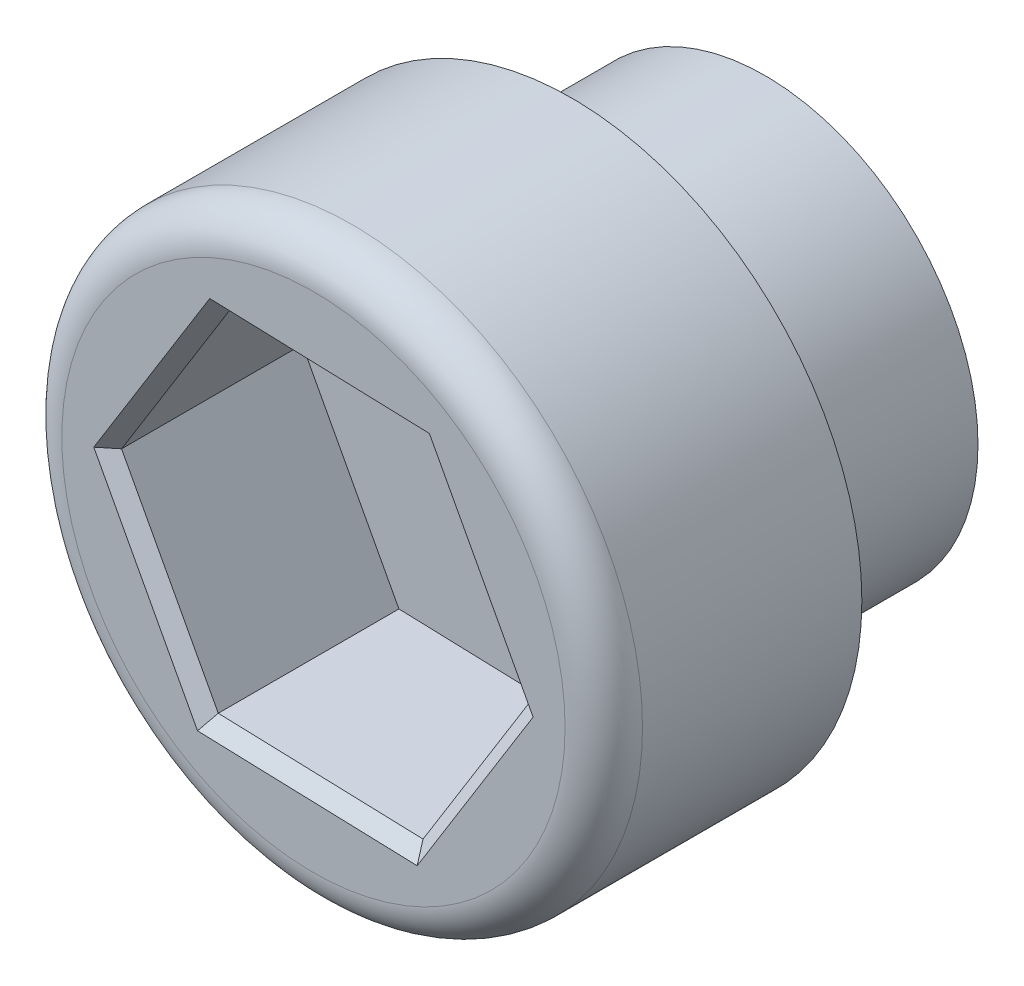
ISO-10303-21;
HEADER;
FILE_DESCRIPTION(('STEP AP214'),'2;1');
FILE_NAME('part.step','',(''),(''),'','','');
FILE_SCHEMA(('AUTOMOTIVE_DESIGN { 1 0 10303 214 1 1 1 1 }'));
ENDSEC;
DATA;
#1=APPLICATION_CONTEXT('core data for automotive mechanical design processes');
#2=APPLICATION_PROTOCOL_DEFINITION('international standard','automotive_design',2000,#1);
#3=PRODUCT_CONTEXT('',#1,'mechanical');
#4=PRODUCT('Part','Part','',(#3));
#5=PRODUCT_RELATED_PRODUCT_CATEGORY('part','',(#4));
#6=PRODUCT_DEFINITION_FORMATION('','',#4);
#7=PRODUCT_DEFINITION_CONTEXT('part definition',#1,'design');
#8=PRODUCT_DEFINITION('design','',#6,#7);
#9=PRODUCT_DEFINITION_SHAPE('','',#8);
#10=(LENGTH_UNIT() NAMED_UNIT(*) SI_UNIT(.MILLI.,.METRE.));
#11=(NAMED_UNIT(*) PLANE_ANGLE_UNIT() SI_UNIT($,.RADIAN.));
#12=(NAMED_UNIT(*) SI_UNIT($,.STERADIAN.) SOLID_ANGLE_UNIT());
#13=UNCERTAINTY_MEASURE_WITH_UNIT(LENGTH_MEASURE(1.E-05),#10,'distance_accuracy_value','');
#14=(GEOMETRIC_REPRESENTATION_CONTEXT(3) GLOBAL_UNCERTAINTY_ASSIGNED_CONTEXT((#13)) GLOBAL_UNIT_ASSIGNED_CONTEXT((#10,
#11,#12)) REPRESENTATION_CONTEXT('',''));
#15=CARTESIAN_POINT('',(0.,0.,0.));
#16=DIRECTION('',(0.,0.,1.));
#17=DIRECTION('',(1.,0.,0.));
#18=AXIS2_PLACEMENT_3D('',#15,#16,#17);
#19=CARTESIAN_POINT('',(0.,0.,3.));
#20=DIRECTION('',(0.,0.,-1.));
#21=DIRECTION('',(-1.,0.,0.));
#22=AXIS2_PLACEMENT_3D('',#19,#20,#21);
#23=CYLINDRICAL_SURFACE('',#22,3.3);
#24=CARTESIAN_POINT('',(0.,0.,3.));
#25=DIRECTION('',(0.,0.,1.));
#26=DIRECTION('',(1.,0.,0.));
#27=AXIS2_PLACEMENT_3D('',#24,#25,#26);
#28=CIRCLE('',#27,3.3);
#29=CARTESIAN_POINT('',(3.3,0.,3.));
#30=VERTEX_POINT('',#29);
#31=EDGE_CURVE('E154',#30,#30,#28,.T.);
#32=ORIENTED_EDGE('',*,*,#31,.F.);
#33=EDGE_LOOP('',(#32));
#34=FACE_BOUND('',#33,.T.);
#35=CARTESIAN_POINT('',(0.,0.,0.));
#36=DIRECTION('',(0.,0.,1.));
#37=DIRECTION('',(1.,0.,0.));
#38=AXIS2_PLACEMENT_3D('',#35,#36,#37);
#39=CIRCLE('',#38,3.3);
#40=CARTESIAN_POINT('',(3.3,0.,0.));
#41=VERTEX_POINT('',#40);
#42=EDGE_CURVE('E153',#41,#41,#39,.T.);
#43=ORIENTED_EDGE('',*,*,#42,.T.);
#44=EDGE_LOOP('',(#43));
#45=FACE_BOUND('',#44,.T.);
#46=ADVANCED_FACE('F33',(#34,#45),#23,.T.);
#47=CARTESIAN_POINT('',(0.,0.,0.));
#48=DIRECTION('',(0.,0.,1.));
#49=DIRECTION('',(1.,0.,0.));
#50=AXIS2_PLACEMENT_3D('',#47,#48,#49);
#51=PLANE('',#50);
#52=ORIENTED_EDGE('',*,*,#42,.F.);
#53=EDGE_LOOP('',(#52));
#54=FACE_BOUND('',#53,.T.);
#55=ADVANCED_FACE('F231',(#54),#51,.F.);
#56=CARTESIAN_POINT('',(0.,0.,7.));
#57=DIRECTION('',(0.,0.,-1.));
#58=DIRECTION('',(-1.,0.,0.));
#59=AXIS2_PLACEMENT_3D('',#56,#57,#58);
#60=CYLINDRICAL_SURFACE('',#59,4.5);
#61=CARTESIAN_POINT('',(0.,0.,6.4));
#62=DIRECTION('',(0.,0.,1.));
#63=DIRECTION('',(1.,0.,0.));
#64=AXIS2_PLACEMENT_3D('',#61,#62,#63);
#65=CIRCLE('',#64,4.5);
#66=CARTESIAN_POINT('',(4.5,0.,6.4));
#67=VERTEX_POINT('',#66);
#68=EDGE_CURVE('E162',#67,#67,#65,.F.);
#69=ORIENTED_EDGE('',*,*,#68,.T.);
#70=EDGE_LOOP('',(#69));
#71=FACE_BOUND('',#70,.T.);
#72=CARTESIAN_POINT('',(0.,0.,3.));
#73=DIRECTION('',(0.,0.,1.));
#74=DIRECTION('',(1.,0.,0.));
#75=AXIS2_PLACEMENT_3D('',#72,#73,#74);
#76=CIRCLE('',#75,4.5);
#77=CARTESIAN_POINT('',(4.5,0.,3.));
#78=VERTEX_POINT('',#77);
#79=EDGE_CURVE('E142',#78,#78,#76,.T.);
#80=ORIENTED_EDGE('',*,*,#79,.T.);
#81=EDGE_LOOP('',(#80));
#82=FACE_BOUND('',#81,.T.);
#83=ADVANCED_FACE('F237',(#71,#82),#60,.T.);
#84=CARTESIAN_POINT('',(0.,0.,7.));
#85=DIRECTION('',(0.,0.,1.));
#86=DIRECTION('',(1.,0.,0.));
#87=AXIS2_PLACEMENT_3D('',#84,#85,#86);
#88=PLANE('',#87);
#89=DIRECTION('',(-0.527537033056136,-0.849532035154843,0.));
#90=VECTOR('',#89,1.);
#91=CARTESIAN_POINT('',(1.66854197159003,-2.90504750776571,7.));
#92=LINE('',#91,#90);
#93=CARTESIAN_POINT('',(3.40461176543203,-0.109325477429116,7.));
#94=VERTEX_POINT('',#93);
#95=CARTESIAN_POINT('',(1.60762724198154,-3.00314301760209,7.));
#96=VERTEX_POINT('',#95);
#97=EDGE_CURVE('E168',#94,#96,#92,.T.);
#98=ORIENTED_EDGE('',*,*,#97,.T.);
#99=DIRECTION('',(-0.999484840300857,0.0320944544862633,0.));
#100=VECTOR('',#99,1.);
#101=CARTESIAN_POINT('',(-1.68157395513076,-2.8975234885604,7.));
#102=LINE('',#101,#100);
#103=CARTESIAN_POINT('',(-1.79698452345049,-2.89381754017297,7.));
#104=VERTEX_POINT('',#103);
#105=EDGE_CURVE('E178',#96,#104,#102,.T.);
#106=ORIENTED_EDGE('',*,*,#105,.T.);
#107=DIRECTION('',(-0.471947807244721,0.881626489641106,0.));
#108=VECTOR('',#107,1.);
#109=CARTESIAN_POINT('',(-3.35011592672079,0.0075240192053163,7.));
#110=LINE('',#109,#108);
#111=CARTESIAN_POINT('',(-3.40461176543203,0.109325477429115,7.));
#112=VERTEX_POINT('',#111);
#113=EDGE_CURVE('E176',#104,#112,#110,.T.);
#114=ORIENTED_EDGE('',*,*,#113,.T.);
#115=DIRECTION('',(0.527537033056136,0.849532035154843,0.));
#116=VECTOR('',#115,1.);
#117=CARTESIAN_POINT('',(-1.66854197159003,2.90504750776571,7.));
#118=LINE('',#117,#116);
#119=CARTESIAN_POINT('',(-1.60762724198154,3.00314301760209,7.));
#120=VERTEX_POINT('',#119);
#121=EDGE_CURVE('E174',#112,#120,#118,.T.);
#122=ORIENTED_EDGE('',*,*,#121,.T.);
#123=DIRECTION('',(0.999484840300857,-0.0320944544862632,0.));
#124=VECTOR('',#123,1.);
#125=CARTESIAN_POINT('',(1.68157395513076,2.8975234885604,7.));
#126=LINE('',#125,#124);
#127=CARTESIAN_POINT('',(1.79698452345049,2.89381754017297,7.));
#128=VERTEX_POINT('',#127);
#129=EDGE_CURVE('E172',#120,#128,#126,.T.);
#130=ORIENTED_EDGE('',*,*,#129,.T.);
#131=DIRECTION('',(0.471947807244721,-0.881626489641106,0.));
#132=VECTOR('',#131,1.);
#133=CARTESIAN_POINT('',(3.35011592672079,-0.00752401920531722,7.));
#134=LINE('',#133,#132);
#135=EDGE_CURVE('E170',#128,#94,#134,.T.);
#136=ORIENTED_EDGE('',*,*,#135,.T.);
#137=EDGE_LOOP('',(#98,#106,#114,#122,#130,#136));
#138=FACE_BOUND('',#137,.T.);
#139=CARTESIAN_POINT('',(0.,0.,7.));
#140=DIRECTION('',(0.,0.,1.));
#141=DIRECTION('',(1.,0.,0.));
#142=AXIS2_PLACEMENT_3D('',#139,#140,#141);
#143=CIRCLE('',#142,3.9);
#144=CARTESIAN_POINT('',(3.9,0.,7.));
#145=VERTEX_POINT('',#144);
#146=EDGE_CURVE('E157',#145,#145,#143,.T.);
#147=ORIENTED_EDGE('',*,*,#146,.T.);
#148=EDGE_LOOP('',(#147));
#149=FACE_BOUND('',#148,.T.);
#150=ADVANCED_FACE('F317',(#138,#149),#88,.T.);
#151=CARTESIAN_POINT('',(0.,0.,3.));
#152=DIRECTION('',(0.,0.,1.));
#153=DIRECTION('',(1.,0.,0.));
#154=AXIS2_PLACEMENT_3D('',#151,#152,#153);
#155=PLANE('',#154);
#156=ORIENTED_EDGE('',*,*,#31,.T.);
#157=EDGE_LOOP('',(#156));
#158=FACE_BOUND('',#157,.T.);
#159=ORIENTED_EDGE('',*,*,#79,.F.);
#160=EDGE_LOOP('',(#159));
#161=FACE_BOUND('',#160,.T.);
#162=ADVANCED_FACE('F227',(#158,#161),#155,.F.);
#163=CARTESIAN_POINT('',(1.67515506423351,2.69762652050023,4.));
#164=DIRECTION('',(0.0320944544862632,0.999484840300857,0.));
#165=DIRECTION('',(-0.999484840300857,0.0320944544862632,0.));
#166=AXIS2_PLACEMENT_3D('',#163,#164,#165);
#167=PLANE('',#166);
#168=DIRECTION('',(0.,0.,1.));
#169=VECTOR('',#168,1.);
#170=CARTESIAN_POINT('',(1.67515506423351,2.69762652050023,4.));
#171=LINE('',#170,#169);
#172=CARTESIAN_POINT('',(1.67515506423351,2.69762652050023,4.));
#173=VERTEX_POINT('',#172);
#174=CARTESIAN_POINT('',(1.67515506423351,2.69762652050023,6.8));
#175=VERTEX_POINT('',#174);
#176=EDGE_CURVE('E140',#173,#175,#171,.T.);
#177=ORIENTED_EDGE('',*,*,#176,.T.);
#178=DIRECTION('',(-0.999484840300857,0.0320944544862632,0.));
#179=VECTOR('',#178,1.);
#180=CARTESIAN_POINT('',(-1.49863556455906,2.79954010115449,6.8));
#181=LINE('',#180,#179);
#182=CARTESIAN_POINT('',(-1.49863556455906,2.79954010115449,6.8));
#183=VERTEX_POINT('',#182);
#184=EDGE_CURVE('E111',#175,#183,#181,.T.);
#185=ORIENTED_EDGE('',*,*,#184,.T.);
#186=DIRECTION('',(0.,0.,1.));
#187=VECTOR('',#186,1.);
#188=CARTESIAN_POINT('',(-1.49863556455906,2.79954010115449,4.));
#189=LINE('',#188,#187);
#190=CARTESIAN_POINT('',(-1.49863556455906,2.79954010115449,4.));
#191=VERTEX_POINT('',#190);
#192=EDGE_CURVE('E104',#191,#183,#189,.T.);
#193=ORIENTED_EDGE('',*,*,#192,.F.);
#194=DIRECTION('',(-0.999484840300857,0.0320944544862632,0.));
#195=VECTOR('',#194,1.);
#196=CARTESIAN_POINT('',(1.67515506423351,2.69762652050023,4.));
#197=LINE('',#196,#195);
#198=EDGE_CURVE('E108',#173,#191,#197,.T.);
#199=ORIENTED_EDGE('',*,*,#198,.F.);
#200=EDGE_LOOP('',(#177,#185,#193,#199));
#201=FACE_BOUND('',#200,.T.);
#202=ADVANCED_FACE('F106',(#201),#167,.F.);
#203=CARTESIAN_POINT('',(3.17379062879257,-0.101913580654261,4.));
#204=DIRECTION('',(0.881626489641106,0.471947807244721,0.));
#205=DIRECTION('',(-0.471947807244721,0.881626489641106,0.));
#206=AXIS2_PLACEMENT_3D('',#203,#204,#205);
#207=PLANE('',#206);
#208=DIRECTION('',(0.,0.,1.));
#209=VECTOR('',#208,1.);
#210=CARTESIAN_POINT('',(3.17379062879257,-0.101913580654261,4.));
#211=LINE('',#210,#209);
#212=CARTESIAN_POINT('',(3.17379062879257,-0.101913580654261,4.));
#213=VERTEX_POINT('',#212);
#214=CARTESIAN_POINT('',(3.17379062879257,-0.101913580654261,6.8));
#215=VERTEX_POINT('',#214);
#216=EDGE_CURVE('E143',#213,#215,#211,.T.);
#217=ORIENTED_EDGE('',*,*,#216,.T.);
#218=DIRECTION('',(-0.471947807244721,0.881626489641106,0.));
#219=VECTOR('',#218,1.);
#220=CARTESIAN_POINT('',(1.67515506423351,2.69762652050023,6.8));
#221=LINE('',#220,#219);
#222=EDGE_CURVE('E42',#215,#175,#221,.T.);
#223=ORIENTED_EDGE('',*,*,#222,.T.);
#224=ORIENTED_EDGE('',*,*,#176,.F.);
#225=DIRECTION('',(-0.471947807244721,0.881626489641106,0.));
#226=VECTOR('',#225,1.);
#227=CARTESIAN_POINT('',(3.17379062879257,-0.101913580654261,4.));
#228=LINE('',#227,#226);
#229=EDGE_CURVE('E115',#213,#173,#228,.T.);
#230=ORIENTED_EDGE('',*,*,#229,.F.);
#231=EDGE_LOOP('',(#217,#223,#224,#230));
#232=FACE_BOUND('',#231,.T.);
#233=ADVANCED_FACE('F219',(#232),#207,.F.);
#234=CARTESIAN_POINT('',(1.49863556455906,-2.79954010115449,4.));
#235=DIRECTION('',(0.849532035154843,-0.527537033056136,0.));
#236=DIRECTION('',(0.527537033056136,0.849532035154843,0.));
#237=AXIS2_PLACEMENT_3D('',#234,#235,#236);
#238=PLANE('',#237);
#239=DIRECTION('',(0.,0.,1.));
#240=VECTOR('',#239,1.);
#241=CARTESIAN_POINT('',(1.49863556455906,-2.79954010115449,4.));
#242=LINE('',#241,#240);
#243=CARTESIAN_POINT('',(1.49863556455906,-2.79954010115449,4.));
#244=VERTEX_POINT('',#243);
#245=CARTESIAN_POINT('',(1.49863556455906,-2.79954010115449,6.8));
#246=VERTEX_POINT('',#245);
#247=EDGE_CURVE('E145',#244,#246,#242,.T.);
#248=ORIENTED_EDGE('',*,*,#247,.T.);
#249=DIRECTION('',(0.527537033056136,0.849532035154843,0.));
#250=VECTOR('',#249,1.);
#251=CARTESIAN_POINT('',(3.17379062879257,-0.101913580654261,6.8));
#252=LINE('',#251,#250);
#253=EDGE_CURVE('E11',#246,#215,#252,.T.);
#254=ORIENTED_EDGE('',*,*,#253,.T.);
#255=ORIENTED_EDGE('',*,*,#216,.F.);
#256=DIRECTION('',(0.527537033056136,0.849532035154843,0.));
#257=VECTOR('',#256,1.);
#258=CARTESIAN_POINT('',(1.49863556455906,-2.79954010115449,4.));
#259=LINE('',#258,#257);
#260=EDGE_CURVE('E137',#244,#213,#259,.T.);
#261=ORIENTED_EDGE('',*,*,#260,.F.);
#262=EDGE_LOOP('',(#248,#254,#255,#261));
#263=FACE_BOUND('',#262,.T.);
#264=ADVANCED_FACE('F218',(#263),#238,.F.);
#265=CARTESIAN_POINT('',(-1.67515506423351,-2.69762652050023,4.));
#266=DIRECTION('',(-0.0320944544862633,-0.999484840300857,0.));
#267=DIRECTION('',(0.999484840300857,-0.0320944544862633,0.));
#268=AXIS2_PLACEMENT_3D('',#265,#266,#267);
#269=PLANE('',#268);
#270=DIRECTION('',(0.,0.,1.));
#271=VECTOR('',#270,1.);
#272=CARTESIAN_POINT('',(-1.67515506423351,-2.69762652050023,4.));
#273=LINE('',#272,#271);
#274=CARTESIAN_POINT('',(-1.67515506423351,-2.69762652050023,4.));
#275=VERTEX_POINT('',#274);
#276=CARTESIAN_POINT('',(-1.67515506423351,-2.69762652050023,6.8));
#277=VERTEX_POINT('',#276);
#278=EDGE_CURVE('E147',#275,#277,#273,.T.);
#279=ORIENTED_EDGE('',*,*,#278,.T.);
#280=DIRECTION('',(0.999484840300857,-0.0320944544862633,0.));
#281=VECTOR('',#280,1.);
#282=CARTESIAN_POINT('',(1.49863556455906,-2.79954010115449,6.8));
#283=LINE('',#282,#281);
#284=EDGE_CURVE('E165',#277,#246,#283,.T.);
#285=ORIENTED_EDGE('',*,*,#284,.T.);
#286=ORIENTED_EDGE('',*,*,#247,.F.);
#287=DIRECTION('',(0.999484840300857,-0.0320944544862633,0.));
#288=VECTOR('',#287,1.);
#289=CARTESIAN_POINT('',(-1.67515506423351,-2.69762652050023,4.));
#290=LINE('',#289,#288);
#291=EDGE_CURVE('E134',#275,#244,#290,.T.);
#292=ORIENTED_EDGE('',*,*,#291,.F.);
#293=EDGE_LOOP('',(#279,#285,#286,#292));
#294=FACE_BOUND('',#293,.T.);
#295=ADVANCED_FACE('F215',(#294),#269,.F.);
#296=CARTESIAN_POINT('',(-3.17379062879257,0.10191358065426,4.));
#297=DIRECTION('',(-0.881626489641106,-0.471947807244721,0.));
#298=DIRECTION('',(0.471947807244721,-0.881626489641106,0.));
#299=AXIS2_PLACEMENT_3D('',#296,#297,#298);
#300=PLANE('',#299);
#301=DIRECTION('',(0.,0.,1.));
#302=VECTOR('',#301,1.);
#303=CARTESIAN_POINT('',(-3.17379062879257,0.10191358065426,4.));
#304=LINE('',#303,#302);
#305=CARTESIAN_POINT('',(-3.17379062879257,0.10191358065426,4.));
#306=VERTEX_POINT('',#305);
#307=CARTESIAN_POINT('',(-3.17379062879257,0.10191358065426,6.8));
#308=VERTEX_POINT('',#307);
#309=EDGE_CURVE('E114',#306,#308,#304,.T.);
#310=ORIENTED_EDGE('',*,*,#309,.T.);
#311=DIRECTION('',(0.471947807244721,-0.881626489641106,0.));
#312=VECTOR('',#311,1.);
#313=CARTESIAN_POINT('',(-1.67515506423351,-2.69762652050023,6.8));
#314=LINE('',#313,#312);
#315=EDGE_CURVE('E181',#308,#277,#314,.T.);
#316=ORIENTED_EDGE('',*,*,#315,.T.);
#317=ORIENTED_EDGE('',*,*,#278,.F.);
#318=DIRECTION('',(0.471947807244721,-0.881626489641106,0.));
#319=VECTOR('',#318,1.);
#320=CARTESIAN_POINT('',(-3.17379062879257,0.10191358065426,4.));
#321=LINE('',#320,#319);
#322=EDGE_CURVE('E124',#306,#275,#321,.T.);
#323=ORIENTED_EDGE('',*,*,#322,.F.);
#324=EDGE_LOOP('',(#310,#316,#317,#323));
#325=FACE_BOUND('',#324,.T.);
#326=ADVANCED_FACE('F211',(#325),#300,.F.);
#327=CARTESIAN_POINT('',(-1.49863556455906,2.79954010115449,4.));
#328=DIRECTION('',(-0.849532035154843,0.527537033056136,0.));
#329=DIRECTION('',(-0.527537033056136,-0.849532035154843,0.));
#330=AXIS2_PLACEMENT_3D('',#327,#328,#329);
#331=PLANE('',#330);
#332=ORIENTED_EDGE('',*,*,#192,.T.);
#333=DIRECTION('',(-0.527537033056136,-0.849532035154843,0.));
#334=VECTOR('',#333,1.);
#335=CARTESIAN_POINT('',(-3.17379062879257,0.10191358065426,6.8));
#336=LINE('',#335,#334);
#337=EDGE_CURVE('E183',#183,#308,#336,.T.);
#338=ORIENTED_EDGE('',*,*,#337,.T.);
#339=ORIENTED_EDGE('',*,*,#309,.F.);
#340=DIRECTION('',(-0.527537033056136,-0.849532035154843,0.));
#341=VECTOR('',#340,1.);
#342=CARTESIAN_POINT('',(-1.49863556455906,2.79954010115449,4.));
#343=LINE('',#342,#341);
#344=EDGE_CURVE('E118',#191,#306,#343,.T.);
#345=ORIENTED_EDGE('',*,*,#344,.F.);
#346=EDGE_LOOP('',(#332,#338,#339,#345));
#347=FACE_BOUND('',#346,.T.);
#348=ADVANCED_FACE('F119',(#347),#331,.F.);
#349=CARTESIAN_POINT('',(0.,0.,4.));
#350=DIRECTION('',(0.,0.,1.));
#351=DIRECTION('',(1.,0.,0.));
#352=AXIS2_PLACEMENT_3D('',#349,#350,#351);
#353=PLANE('',#352);
#354=ORIENTED_EDGE('',*,*,#198,.T.);
#355=ORIENTED_EDGE('',*,*,#344,.T.);
#356=ORIENTED_EDGE('',*,*,#322,.T.);
#357=ORIENTED_EDGE('',*,*,#291,.T.);
#358=ORIENTED_EDGE('',*,*,#260,.T.);
#359=ORIENTED_EDGE('',*,*,#229,.T.);
#360=EDGE_LOOP('',(#354,#355,#356,#357,#358,#359));
#361=FACE_BOUND('',#360,.T.);
#362=ADVANCED_FACE('F126',(#361),#353,.T.);
#363=CARTESIAN_POINT('',(0.,0.,6.4));
#364=DIRECTION('',(0.,0.,1.));
#365=DIRECTION('',(1.,0.,0.));
#366=AXIS2_PLACEMENT_3D('',#363,#364,#365);
#367=TOROIDAL_SURFACE('',#366,3.9,0.6);
#368=ORIENTED_EDGE('',*,*,#68,.F.);
#369=EDGE_LOOP('',(#368));
#370=FACE_BOUND('',#369,.T.);
#371=ORIENTED_EDGE('',*,*,#146,.F.);
#372=EDGE_LOOP('',(#371));
#373=FACE_BOUND('',#372,.T.);
#374=ADVANCED_FACE('F244',(#370,#373),#367,.T.);
#375=CARTESIAN_POINT('',(1.67515506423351,2.69762652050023,6.8));
#376=DIRECTION('',(-0.0226942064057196,-0.706742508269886,0.70710678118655));
#377=DIRECTION('',(0.999484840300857,-0.0320944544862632,0.));
#378=AXIS2_PLACEMENT_3D('',#375,#376,#377);
#379=PLANE('',#378);
#380=DIRECTION('',(-0.398780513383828,-0.642185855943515,-0.654653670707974));
#381=VECTOR('',#380,1.);
#382=CARTESIAN_POINT('',(1.67515506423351,2.69762652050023,6.8));
#383=LINE('',#382,#381);
#384=EDGE_CURVE('E131',#128,#175,#383,.T.);
#385=ORIENTED_EDGE('',*,*,#384,.F.);
#386=ORIENTED_EDGE('',*,*,#129,.F.);
#387=DIRECTION('',(0.356759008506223,-0.666446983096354,-0.654653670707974));
#388=VECTOR('',#387,1.);
#389=CARTESIAN_POINT('',(-1.49863556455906,2.79954010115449,6.8));
#390=LINE('',#389,#388);
#391=EDGE_CURVE('E37',#183,#120,#390,.F.);
#392=ORIENTED_EDGE('',*,*,#391,.F.);
#393=ORIENTED_EDGE('',*,*,#184,.F.);
#394=EDGE_LOOP('',(#385,#386,#392,#393));
#395=FACE_BOUND('',#394,.T.);
#396=ADVANCED_FACE('F35',(#395),#379,.T.);
#397=CARTESIAN_POINT('',(-1.49863556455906,2.79954010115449,6.8));
#398=DIRECTION('',(0.600709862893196,-0.373025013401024,0.70710678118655));
#399=DIRECTION('',(0.527537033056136,0.849532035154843,0.));
#400=AXIS2_PLACEMENT_3D('',#397,#398,#399);
#401=PLANE('',#400);
#402=ORIENTED_EDGE('',*,*,#391,.T.);
#403=ORIENTED_EDGE('',*,*,#121,.F.);
#404=DIRECTION('',(0.755539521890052,-0.024261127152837,-0.654653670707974));
#405=VECTOR('',#404,1.);
#406=CARTESIAN_POINT('',(-3.17379062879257,0.10191358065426,6.8));
#407=LINE('',#406,#405);
#408=EDGE_CURVE('E194',#308,#112,#407,.F.);
#409=ORIENTED_EDGE('',*,*,#408,.F.);
#410=ORIENTED_EDGE('',*,*,#337,.F.);
#411=EDGE_LOOP('',(#402,#403,#409,#410));
#412=FACE_BOUND('',#411,.T.);
#413=ADVANCED_FACE('F208',(#412),#401,.T.);
#414=CARTESIAN_POINT('',(3.17379062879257,-0.101913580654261,6.8));
#415=DIRECTION('',(-0.623404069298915,-0.333717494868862,0.70710678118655));
#416=DIRECTION('',(0.471947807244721,-0.881626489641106,0.));
#417=AXIS2_PLACEMENT_3D('',#414,#415,#416);
#418=PLANE('',#417);
#419=ORIENTED_EDGE('',*,*,#384,.T.);
#420=ORIENTED_EDGE('',*,*,#222,.F.);
#421=DIRECTION('',(-0.755539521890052,0.0242611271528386,-0.654653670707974));
#422=VECTOR('',#421,1.);
#423=CARTESIAN_POINT('',(3.17379062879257,-0.101913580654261,6.8));
#424=LINE('',#423,#422);
#425=EDGE_CURVE('E191',#94,#215,#424,.T.);
#426=ORIENTED_EDGE('',*,*,#425,.F.);
#427=ORIENTED_EDGE('',*,*,#135,.F.);
#428=EDGE_LOOP('',(#419,#420,#426,#427));
#429=FACE_BOUND('',#428,.T.);
#430=ADVANCED_FACE('F200',(#429),#418,.T.);
#431=CARTESIAN_POINT('',(-3.17379062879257,0.10191358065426,6.8));
#432=DIRECTION('',(0.623404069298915,0.333717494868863,0.70710678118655));
#433=DIRECTION('',(-0.471947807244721,0.881626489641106,0.));
#434=AXIS2_PLACEMENT_3D('',#431,#432,#433);
#435=PLANE('',#434);
#436=ORIENTED_EDGE('',*,*,#408,.T.);
#437=ORIENTED_EDGE('',*,*,#113,.F.);
#438=DIRECTION('',(0.398780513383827,0.642185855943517,-0.654653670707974));
#439=VECTOR('',#438,1.);
#440=CARTESIAN_POINT('',(-1.67515506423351,-2.69762652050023,6.8));
#441=LINE('',#440,#439);
#442=EDGE_CURVE('E189',#277,#104,#441,.F.);
#443=ORIENTED_EDGE('',*,*,#442,.F.);
#444=ORIENTED_EDGE('',*,*,#315,.F.);
#445=EDGE_LOOP('',(#436,#437,#443,#444));
#446=FACE_BOUND('',#445,.T.);
#447=ADVANCED_FACE('F255',(#446),#435,.T.);
#448=CARTESIAN_POINT('',(1.49863556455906,-2.79954010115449,6.8));
#449=DIRECTION('',(-0.600709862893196,0.373025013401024,0.70710678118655));
#450=DIRECTION('',(-0.527537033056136,-0.849532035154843,0.));
#451=AXIS2_PLACEMENT_3D('',#448,#449,#450);
#452=PLANE('',#451);
#453=ORIENTED_EDGE('',*,*,#425,.T.);
#454=ORIENTED_EDGE('',*,*,#253,.F.);
#455=DIRECTION('',(0.356759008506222,-0.666446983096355,0.654653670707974));
#456=VECTOR('',#455,1.);
#457=CARTESIAN_POINT('',(1.07045397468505,-1.99967150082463,6.01428571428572));
#458=LINE('',#457,#456);
#459=EDGE_CURVE('E187',#96,#246,#458,.F.);
#460=ORIENTED_EDGE('',*,*,#459,.F.);
#461=ORIENTED_EDGE('',*,*,#97,.F.);
#462=EDGE_LOOP('',(#453,#454,#460,#461));
#463=FACE_BOUND('',#462,.T.);
#464=ADVANCED_FACE('F251',(#463),#452,.T.);
#465=CARTESIAN_POINT('',(-1.67515506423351,-2.69762652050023,6.8));
#466=DIRECTION('',(0.0226942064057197,0.706742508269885,0.707106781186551));
#467=DIRECTION('',(-0.999484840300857,0.0320944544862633,0.));
#468=AXIS2_PLACEMENT_3D('',#465,#466,#467);
#469=PLANE('',#468);
#470=ORIENTED_EDGE('',*,*,#442,.T.);
#471=ORIENTED_EDGE('',*,*,#105,.F.);
#472=ORIENTED_EDGE('',*,*,#459,.T.);
#473=ORIENTED_EDGE('',*,*,#284,.F.);
#474=EDGE_LOOP('',(#470,#471,#472,#473));
#475=FACE_BOUND('',#474,.T.);
#476=ADVANCED_FACE('F248',(#475),#469,.T.);
#477=CLOSED_SHELL('',(#46,#55,#83,#150,#162,#202,#233,#264,#295,#326,#348,#362,#374,#396,#413,
#430,#447,#464,#476));
#478=MANIFOLD_SOLID_BREP('B2',#477);
#479=ADVANCED_BREP_SHAPE_REPRESENTATION('',(#18,#478),#14);
#480=SHAPE_DEFINITION_REPRESENTATION(#9,#479);
ENDSEC;
END-ISO-10303-21;
